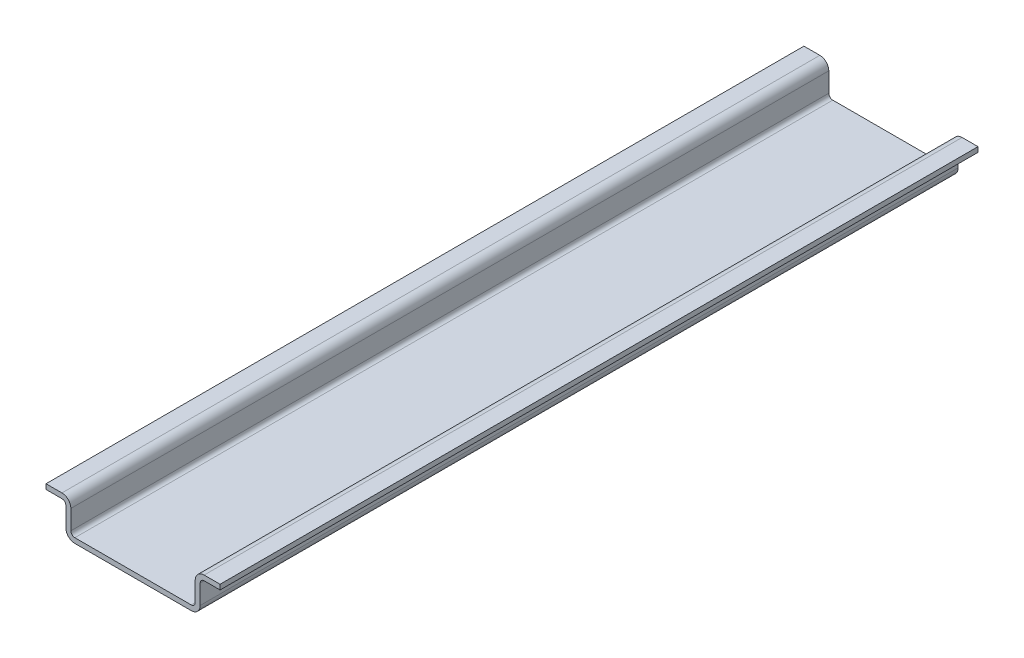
from build123d import *

# Parameters (mm, degrees)
EXTRUDE1_DEPTH = 76.2


with BuildPart() as part:
    # Sketch1 → Extrude1 (new, symmetric)
    with BuildSketch(Plane.XY):
        with BuildLine():
            Line((-11.7, 1), (11.7, 1))
            ThreePointArc((11.7, 1), (12.265685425, 1.234314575), (12.5, 1.8))
            Line((12.5, 1.8), (12.5, 5.7))
            ThreePointArc((12.5, 5.7), (13.027207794, 6.972792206), (14.3, 7.5))
            Line((14.3, 7.5), (17.5, 7.5))
            Line((17.5, 7.5), (17.5, 6.5))
            Line((17.5, 6.5), (14.3, 6.5))
            ThreePointArc((14.3, 6.5), (13.734314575, 6.265685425), (13.5, 5.7))
            Line((13.5, 5.7), (13.5, 1.8))
            ThreePointArc((13.5, 1.8), (12.972792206, 0.527207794), (11.7, 0))
            Line((11.7, 0), (-11.7, 0))
            ThreePointArc((-11.7, 0), (-12.972792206, 0.527207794), (-13.5, 1.8))
            Line((-13.5, 1.8), (-13.5, 5.7))
            ThreePointArc((-13.5, 5.7), (-13.734314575, 6.265685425), (-14.3, 6.5))
            Line((-14.3, 6.5), (-17.5, 6.5))
            Line((-17.5, 6.5), (-17.5, 7.5))
            Line((-17.5, 7.5), (-14.3, 7.5))
            ThreePointArc((-14.3, 7.5), (-13.027207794, 6.972792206), (-12.5, 5.7))
            Line((-12.5, 5.7), (-12.5, 1.8))
            ThreePointArc((-12.5, 1.8), (-12.265685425, 1.234314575), (-11.7, 1))
        make_face()
    extrude(amount=EXTRUDE1_DEPTH, both=True)


solid = part.part
